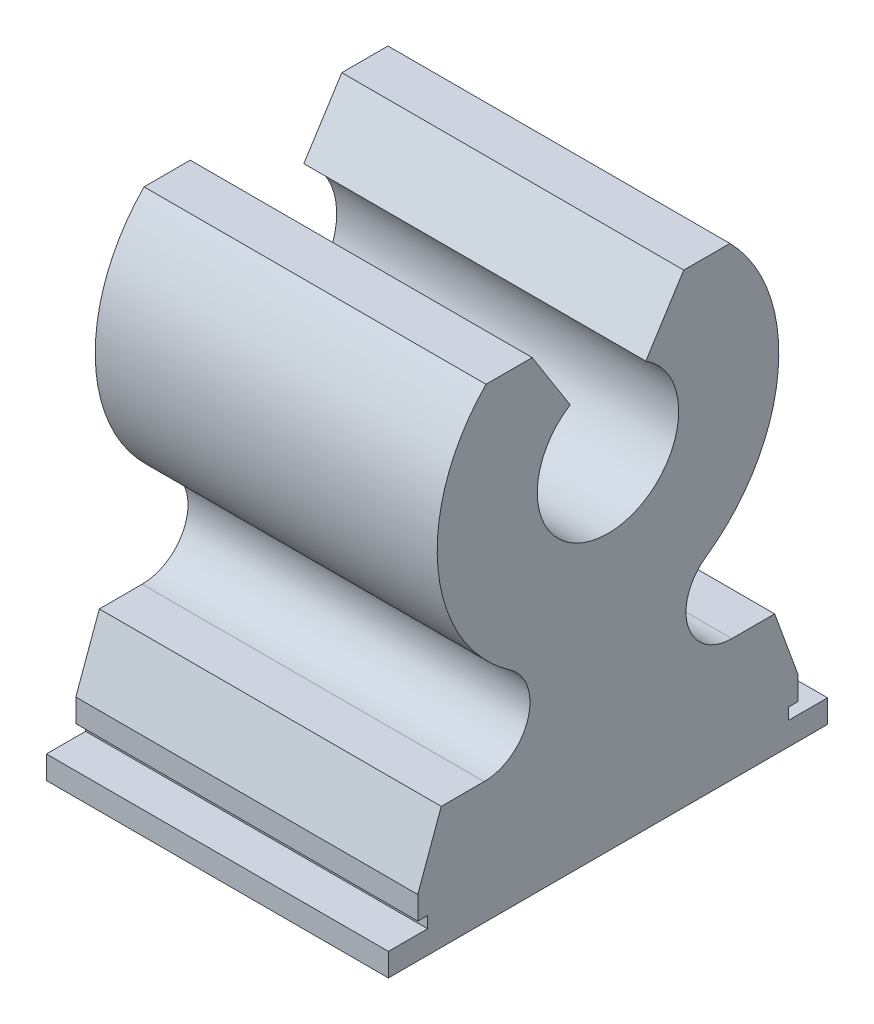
ISO-10303-21;
HEADER;
FILE_DESCRIPTION(('STEP AP214'),'2;1');
FILE_NAME('part.step','',(''),(''),'','','');
FILE_SCHEMA(('AUTOMOTIVE_DESIGN { 1 0 10303 214 1 1 1 1 }'));
ENDSEC;
DATA;
#1=APPLICATION_CONTEXT('core data for automotive mechanical design processes');
#2=APPLICATION_PROTOCOL_DEFINITION('international standard','automotive_design',2000,#1);
#3=PRODUCT_CONTEXT('',#1,'mechanical');
#4=PRODUCT('Part','Part','',(#3));
#5=PRODUCT_RELATED_PRODUCT_CATEGORY('part','',(#4));
#6=PRODUCT_DEFINITION_FORMATION('','',#4);
#7=PRODUCT_DEFINITION_CONTEXT('part definition',#1,'design');
#8=PRODUCT_DEFINITION('design','',#6,#7);
#9=PRODUCT_DEFINITION_SHAPE('','',#8);
#10=(LENGTH_UNIT() NAMED_UNIT(*) SI_UNIT(.MILLI.,.METRE.));
#11=(NAMED_UNIT(*) PLANE_ANGLE_UNIT() SI_UNIT($,.RADIAN.));
#12=(NAMED_UNIT(*) SI_UNIT($,.STERADIAN.) SOLID_ANGLE_UNIT());
#13=UNCERTAINTY_MEASURE_WITH_UNIT(LENGTH_MEASURE(1.E-05),#10,'distance_accuracy_value','');
#14=(GEOMETRIC_REPRESENTATION_CONTEXT(3) GLOBAL_UNCERTAINTY_ASSIGNED_CONTEXT((#13)) GLOBAL_UNIT_ASSIGNED_CONTEXT((#10,
#11,#12)) REPRESENTATION_CONTEXT('',''));
#15=CARTESIAN_POINT('',(0.,0.,0.));
#16=DIRECTION('',(0.,0.,1.));
#17=DIRECTION('',(1.,0.,0.));
#18=AXIS2_PLACEMENT_3D('',#15,#16,#17);
#19=CARTESIAN_POINT('',(8.9,-9.,5.715));
#20=DIRECTION('',(0.,0.,-1.));
#21=DIRECTION('',(-1.,0.,0.));
#22=AXIS2_PLACEMENT_3D('',#19,#20,#21);
#23=PLANE('',#22);
#24=DIRECTION('',(0.,-1.,0.));
#25=VECTOR('',#24,1.);
#26=CARTESIAN_POINT('',(0.,-9.,5.715));
#27=LINE('',#26,#25);
#28=CARTESIAN_POINT('',(0.,-8.4,5.715));
#29=VERTEX_POINT('',#28);
#30=CARTESIAN_POINT('',(0.,-9.,5.715));
#31=VERTEX_POINT('',#30);
#32=EDGE_CURVE('E336',#29,#31,#27,.T.);
#33=ORIENTED_EDGE('',*,*,#32,.T.);
#34=DIRECTION('',(-1.,0.,0.));
#35=VECTOR('',#34,1.);
#36=CARTESIAN_POINT('',(8.9,-9.,5.715));
#37=LINE('',#36,#35);
#38=CARTESIAN_POINT('',(8.9,-9.,5.715));
#39=VERTEX_POINT('',#38);
#40=EDGE_CURVE('E291',#39,#31,#37,.T.);
#41=ORIENTED_EDGE('',*,*,#40,.F.);
#42=DIRECTION('',(0.,-1.,0.));
#43=VECTOR('',#42,1.);
#44=CARTESIAN_POINT('',(8.9,-9.,5.715));
#45=LINE('',#44,#43);
#46=CARTESIAN_POINT('',(8.9,-8.4,5.715));
#47=VERTEX_POINT('',#46);
#48=EDGE_CURVE('E234',#47,#39,#45,.T.);
#49=ORIENTED_EDGE('',*,*,#48,.F.);
#50=DIRECTION('',(-1.,0.,0.));
#51=VECTOR('',#50,1.);
#52=CARTESIAN_POINT('',(8.9,-8.4,5.715));
#53=LINE('',#52,#51);
#54=EDGE_CURVE('E235',#47,#29,#53,.T.);
#55=ORIENTED_EDGE('',*,*,#54,.T.);
#56=EDGE_LOOP('',(#33,#41,#49,#55));
#57=FACE_BOUND('',#56,.T.);
#58=ADVANCED_FACE('F32',(#57),#23,.F.);
#59=CARTESIAN_POINT('',(8.9,-9.,5.715));
#60=DIRECTION('',(0.,1.,0.));
#61=DIRECTION('',(0.,0.,1.));
#62=AXIS2_PLACEMENT_3D('',#59,#60,#61);
#63=PLANE('',#62);
#64=DIRECTION('',(0.,0.,-1.));
#65=VECTOR('',#64,1.);
#66=CARTESIAN_POINT('',(0.,-9.,5.715));
#67=LINE('',#66,#65);
#68=CARTESIAN_POINT('',(0.,-9.,-5.715));
#69=VERTEX_POINT('',#68);
#70=EDGE_CURVE('E338',#31,#69,#67,.T.);
#71=ORIENTED_EDGE('',*,*,#70,.T.);
#72=DIRECTION('',(-1.,0.,0.));
#73=VECTOR('',#72,1.);
#74=CARTESIAN_POINT('',(8.9,-9.,-5.715));
#75=LINE('',#74,#73);
#76=CARTESIAN_POINT('',(8.9,-9.,-5.715));
#77=VERTEX_POINT('',#76);
#78=EDGE_CURVE('E289',#77,#69,#75,.T.);
#79=ORIENTED_EDGE('',*,*,#78,.F.);
#80=DIRECTION('',(0.,0.,-1.));
#81=VECTOR('',#80,1.);
#82=CARTESIAN_POINT('',(8.9,-9.,5.715));
#83=LINE('',#82,#81);
#84=EDGE_CURVE('E385',#39,#77,#83,.T.);
#85=ORIENTED_EDGE('',*,*,#84,.F.);
#86=ORIENTED_EDGE('',*,*,#40,.T.);
#87=EDGE_LOOP('',(#71,#79,#85,#86));
#88=FACE_BOUND('',#87,.T.);
#89=ADVANCED_FACE('F434',(#88),#63,.F.);
#90=CARTESIAN_POINT('',(8.9,-9.,-5.715));
#91=DIRECTION('',(0.,0.,1.));
#92=DIRECTION('',(1.,0.,0.));
#93=AXIS2_PLACEMENT_3D('',#90,#91,#92);
#94=PLANE('',#93);
#95=DIRECTION('',(0.,1.,0.));
#96=VECTOR('',#95,1.);
#97=CARTESIAN_POINT('',(0.,-9.,-5.715));
#98=LINE('',#97,#96);
#99=CARTESIAN_POINT('',(0.,-8.4,-5.715));
#100=VERTEX_POINT('',#99);
#101=EDGE_CURVE('E340',#69,#100,#98,.T.);
#102=ORIENTED_EDGE('',*,*,#101,.T.);
#103=DIRECTION('',(-1.,0.,0.));
#104=VECTOR('',#103,1.);
#105=CARTESIAN_POINT('',(8.9,-8.4,-5.715));
#106=LINE('',#105,#104);
#107=CARTESIAN_POINT('',(8.9,-8.4,-5.715));
#108=VERTEX_POINT('',#107);
#109=EDGE_CURVE('E286',#108,#100,#106,.T.);
#110=ORIENTED_EDGE('',*,*,#109,.F.);
#111=DIRECTION('',(0.,1.,0.));
#112=VECTOR('',#111,1.);
#113=CARTESIAN_POINT('',(8.9,-9.,-5.715));
#114=LINE('',#113,#112);
#115=EDGE_CURVE('E387',#77,#108,#114,.T.);
#116=ORIENTED_EDGE('',*,*,#115,.F.);
#117=ORIENTED_EDGE('',*,*,#78,.T.);
#118=EDGE_LOOP('',(#102,#110,#116,#117));
#119=FACE_BOUND('',#118,.T.);
#120=ADVANCED_FACE('F430',(#119),#94,.F.);
#121=CARTESIAN_POINT('',(8.9,-8.4,-5.715));
#122=DIRECTION('',(0.,-1.,0.));
#123=DIRECTION('',(0.,0.,-1.));
#124=AXIS2_PLACEMENT_3D('',#121,#122,#123);
#125=PLANE('',#124);
#126=DIRECTION('',(0.,0.,1.));
#127=VECTOR('',#126,1.);
#128=CARTESIAN_POINT('',(0.,-8.4,-5.715));
#129=LINE('',#128,#127);
#130=CARTESIAN_POINT('',(0.,-8.4,-4.695));
#131=VERTEX_POINT('',#130);
#132=EDGE_CURVE('E342',#100,#131,#129,.T.);
#133=ORIENTED_EDGE('',*,*,#132,.T.);
#134=DIRECTION('',(-1.,0.,0.));
#135=VECTOR('',#134,1.);
#136=CARTESIAN_POINT('',(8.9,-8.4,-4.695));
#137=LINE('',#136,#135);
#138=CARTESIAN_POINT('',(8.9,-8.4,-4.695));
#139=VERTEX_POINT('',#138);
#140=EDGE_CURVE('E283',#139,#131,#137,.T.);
#141=ORIENTED_EDGE('',*,*,#140,.F.);
#142=DIRECTION('',(0.,0.,1.));
#143=VECTOR('',#142,1.);
#144=CARTESIAN_POINT('',(8.9,-8.4,-5.715));
#145=LINE('',#144,#143);
#146=EDGE_CURVE('E389',#108,#139,#145,.T.);
#147=ORIENTED_EDGE('',*,*,#146,.F.);
#148=ORIENTED_EDGE('',*,*,#109,.T.);
#149=EDGE_LOOP('',(#133,#141,#147,#148));
#150=FACE_BOUND('',#149,.T.);
#151=ADVANCED_FACE('F426',(#150),#125,.F.);
#152=CARTESIAN_POINT('',(8.9,-8.4,-4.695));
#153=DIRECTION('',(0.,0.,1.));
#154=DIRECTION('',(0.,-1.,0.));
#155=AXIS2_PLACEMENT_3D('',#152,#153,#154);
#156=PLANE('',#155);
#157=DIRECTION('',(0.,1.,0.));
#158=VECTOR('',#157,1.);
#159=CARTESIAN_POINT('',(0.,-8.4,-4.695));
#160=LINE('',#159,#158);
#161=CARTESIAN_POINT('',(0.,-8.1,-4.695));
#162=VERTEX_POINT('',#161);
#163=EDGE_CURVE('E344',#131,#162,#160,.T.);
#164=ORIENTED_EDGE('',*,*,#163,.T.);
#165=DIRECTION('',(-1.,0.,0.));
#166=VECTOR('',#165,1.);
#167=CARTESIAN_POINT('',(8.9,-8.1,-4.695));
#168=LINE('',#167,#166);
#169=CARTESIAN_POINT('',(8.9,-8.1,-4.695));
#170=VERTEX_POINT('',#169);
#171=EDGE_CURVE('E280',#170,#162,#168,.T.);
#172=ORIENTED_EDGE('',*,*,#171,.F.);
#173=DIRECTION('',(0.,1.,0.));
#174=VECTOR('',#173,1.);
#175=CARTESIAN_POINT('',(8.9,-8.4,-4.695));
#176=LINE('',#175,#174);
#177=EDGE_CURVE('E391',#139,#170,#176,.T.);
#178=ORIENTED_EDGE('',*,*,#177,.F.);
#179=ORIENTED_EDGE('',*,*,#140,.T.);
#180=EDGE_LOOP('',(#164,#172,#178,#179));
#181=FACE_BOUND('',#180,.T.);
#182=ADVANCED_FACE('F421',(#181),#156,.F.);
#183=CARTESIAN_POINT('',(8.9,-8.1,-4.695));
#184=DIRECTION('',(0.,1.,0.));
#185=DIRECTION('',(0.,0.,1.));
#186=AXIS2_PLACEMENT_3D('',#183,#184,#185);
#187=PLANE('',#186);
#188=DIRECTION('',(0.,0.,-1.));
#189=VECTOR('',#188,1.);
#190=CARTESIAN_POINT('',(0.,-8.1,-4.695));
#191=LINE('',#190,#189);
#192=CARTESIAN_POINT('',(0.,-8.1,-4.95));
#193=VERTEX_POINT('',#192);
#194=EDGE_CURVE('E346',#162,#193,#191,.T.);
#195=ORIENTED_EDGE('',*,*,#194,.T.);
#196=DIRECTION('',(-1.,0.,0.));
#197=VECTOR('',#196,1.);
#198=CARTESIAN_POINT('',(8.9,-8.1,-4.95));
#199=LINE('',#198,#197);
#200=CARTESIAN_POINT('',(8.9,-8.1,-4.95));
#201=VERTEX_POINT('',#200);
#202=EDGE_CURVE('E277',#201,#193,#199,.T.);
#203=ORIENTED_EDGE('',*,*,#202,.F.);
#204=DIRECTION('',(0.,0.,-1.));
#205=VECTOR('',#204,1.);
#206=CARTESIAN_POINT('',(8.9,-8.1,-4.695));
#207=LINE('',#206,#205);
#208=EDGE_CURVE('E393',#170,#201,#207,.T.);
#209=ORIENTED_EDGE('',*,*,#208,.F.);
#210=ORIENTED_EDGE('',*,*,#171,.T.);
#211=EDGE_LOOP('',(#195,#203,#209,#210));
#212=FACE_BOUND('',#211,.T.);
#213=ADVANCED_FACE('F415',(#212),#187,.F.);
#214=CARTESIAN_POINT('',(8.9,-7.5,-4.95));
#215=DIRECTION('',(0.,0.,1.));
#216=DIRECTION('',(1.,0.,0.));
#217=AXIS2_PLACEMENT_3D('',#214,#215,#216);
#218=PLANE('',#217);
#219=DIRECTION('',(0.,1.,0.));
#220=VECTOR('',#219,1.);
#221=CARTESIAN_POINT('',(0.,-7.5,-4.95));
#222=LINE('',#221,#220);
#223=CARTESIAN_POINT('',(0.,-7.5,-4.95));
#224=VERTEX_POINT('',#223);
#225=EDGE_CURVE('E348',#193,#224,#222,.T.);
#226=ORIENTED_EDGE('',*,*,#225,.T.);
#227=DIRECTION('',(-1.,0.,0.));
#228=VECTOR('',#227,1.);
#229=CARTESIAN_POINT('',(8.9,-7.5,-4.95));
#230=LINE('',#229,#228);
#231=CARTESIAN_POINT('',(8.9,-7.5,-4.95));
#232=VERTEX_POINT('',#231);
#233=EDGE_CURVE('E274',#232,#224,#230,.T.);
#234=ORIENTED_EDGE('',*,*,#233,.F.);
#235=DIRECTION('',(0.,1.,0.));
#236=VECTOR('',#235,1.);
#237=CARTESIAN_POINT('',(8.9,-7.5,-4.95));
#238=LINE('',#237,#236);
#239=EDGE_CURVE('E395',#201,#232,#238,.T.);
#240=ORIENTED_EDGE('',*,*,#239,.F.);
#241=ORIENTED_EDGE('',*,*,#202,.T.);
#242=EDGE_LOOP('',(#226,#234,#240,#241));
#243=FACE_BOUND('',#242,.T.);
#244=ADVANCED_FACE('F411',(#243),#218,.F.);
#245=CARTESIAN_POINT('',(8.9,-5.82,-4.33853000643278));
#246=DIRECTION('',(0.,-0.342020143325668,0.939692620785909));
#247=DIRECTION('',(0.,-0.939692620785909,-0.342020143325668));
#248=AXIS2_PLACEMENT_3D('',#245,#246,#247);
#249=PLANE('',#248);
#250=DIRECTION('',(0.,0.939692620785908,0.342020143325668));
#251=VECTOR('',#250,1.);
#252=CARTESIAN_POINT('',(0.,-5.82,-4.33853000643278));
#253=LINE('',#252,#251);
#254=CARTESIAN_POINT('',(0.,-5.82,-4.33853000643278));
#255=VERTEX_POINT('',#254);
#256=EDGE_CURVE('E350',#224,#255,#253,.T.);
#257=ORIENTED_EDGE('',*,*,#256,.T.);
#258=DIRECTION('',(-1.,0.,0.));
#259=VECTOR('',#258,1.);
#260=CARTESIAN_POINT('',(8.9,-5.82,-4.33853000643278));
#261=LINE('',#260,#259);
#262=CARTESIAN_POINT('',(8.9,-5.82,-4.33853000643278));
#263=VERTEX_POINT('',#262);
#264=EDGE_CURVE('E271',#263,#255,#261,.T.);
#265=ORIENTED_EDGE('',*,*,#264,.F.);
#266=DIRECTION('',(0.,0.939692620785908,0.342020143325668));
#267=VECTOR('',#266,1.);
#268=CARTESIAN_POINT('',(8.9,-5.82,-4.33853000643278));
#269=LINE('',#268,#267);
#270=EDGE_CURVE('E397',#232,#263,#269,.T.);
#271=ORIENTED_EDGE('',*,*,#270,.F.);
#272=ORIENTED_EDGE('',*,*,#233,.T.);
#273=EDGE_LOOP('',(#257,#265,#271,#272));
#274=FACE_BOUND('',#273,.T.);
#275=ADVANCED_FACE('F407',(#274),#249,.F.);
#276=CARTESIAN_POINT('',(8.9,-5.82,-4.33853000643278));
#277=DIRECTION('',(0.,-1.,0.));
#278=DIRECTION('',(0.,0.,-1.));
#279=AXIS2_PLACEMENT_3D('',#276,#277,#278);
#280=PLANE('',#279);
#281=DIRECTION('',(0.,0.,1.));
#282=VECTOR('',#281,1.);
#283=CARTESIAN_POINT('',(0.,-5.82,-4.33853000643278));
#284=LINE('',#283,#282);
#285=CARTESIAN_POINT('',(0.,-5.82,-3.22369685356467));
#286=VERTEX_POINT('',#285);
#287=EDGE_CURVE('E352',#255,#286,#284,.T.);
#288=ORIENTED_EDGE('',*,*,#287,.T.);
#289=DIRECTION('',(-1.,0.,0.));
#290=VECTOR('',#289,1.);
#291=CARTESIAN_POINT('',(8.9,-5.82,-3.22369685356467));
#292=LINE('',#291,#290);
#293=CARTESIAN_POINT('',(8.9,-5.82,-3.22369685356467));
#294=VERTEX_POINT('',#293);
#295=EDGE_CURVE('E268',#294,#286,#292,.T.);
#296=ORIENTED_EDGE('',*,*,#295,.F.);
#297=DIRECTION('',(0.,0.,1.));
#298=VECTOR('',#297,1.);
#299=CARTESIAN_POINT('',(8.9,-5.82,-4.33853000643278));
#300=LINE('',#299,#298);
#301=EDGE_CURVE('E369',#263,#294,#300,.T.);
#302=ORIENTED_EDGE('',*,*,#301,.F.);
#303=ORIENTED_EDGE('',*,*,#264,.T.);
#304=EDGE_LOOP('',(#288,#296,#302,#303));
#305=FACE_BOUND('',#304,.T.);
#306=ADVANCED_FACE('F402',(#305),#280,.F.);
#307=CARTESIAN_POINT('',(8.9,-4.62630314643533,-3.22369685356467));
#308=DIRECTION('',(-1.,0.,0.));
#309=DIRECTION('',(0.,0.,1.));
#310=AXIS2_PLACEMENT_3D('',#307,#308,#309);
#311=CYLINDRICAL_SURFACE('',#310,1.19369685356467);
#312=CARTESIAN_POINT('',(0.,-4.62630314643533,-3.22369685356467));
#313=DIRECTION('',(-1.,0.,0.));
#314=DIRECTION('',(0.,0.,1.));
#315=AXIS2_PLACEMENT_3D('',#312,#313,#314);
#316=CIRCLE('',#315,1.19369685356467);
#317=CARTESIAN_POINT('',(0.,-3.64692729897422,-2.5412489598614));
#318=VERTEX_POINT('',#317);
#319=EDGE_CURVE('E212',#286,#318,#316,.T.);
#320=ORIENTED_EDGE('',*,*,#319,.T.);
#321=DIRECTION('',(-1.,0.,0.));
#322=VECTOR('',#321,1.);
#323=CARTESIAN_POINT('',(8.9,-3.64692729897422,-2.5412489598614));
#324=LINE('',#323,#322);
#325=CARTESIAN_POINT('',(8.9,-3.64692729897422,-2.5412489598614));
#326=VERTEX_POINT('',#325);
#327=EDGE_CURVE('E265',#326,#318,#324,.T.);
#328=ORIENTED_EDGE('',*,*,#327,.F.);
#329=CARTESIAN_POINT('',(8.9,-4.62630314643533,-3.22369685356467));
#330=DIRECTION('',(-1.,0.,0.));
#331=DIRECTION('',(0.,0.,1.));
#332=AXIS2_PLACEMENT_3D('',#329,#330,#331);
#333=CIRCLE('',#332,1.19369685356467);
#334=EDGE_CURVE('E365',#294,#326,#333,.T.);
#335=ORIENTED_EDGE('',*,*,#334,.F.);
#336=ORIENTED_EDGE('',*,*,#295,.T.);
#337=EDGE_LOOP('',(#320,#328,#335,#336));
#338=FACE_BOUND('',#337,.T.);
#339=ADVANCED_FACE('F356',(#338),#311,.F.);
#340=CARTESIAN_POINT('',(8.9,0.,0.));
#341=DIRECTION('',(-1.,0.,0.));
#342=DIRECTION('',(0.,0.,1.));
#343=AXIS2_PLACEMENT_3D('',#340,#341,#342);
#344=CYLINDRICAL_SURFACE('',#343,4.445);
#345=CARTESIAN_POINT('',(0.,0.,0.));
#346=DIRECTION('',(1.,0.,0.));
#347=DIRECTION('',(0.,0.,-1.));
#348=AXIS2_PLACEMENT_3D('',#345,#346,#347);
#349=CIRCLE('',#348,4.445);
#350=CARTESIAN_POINT('',(0.,3.1115,-3.1743649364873));
#351=VERTEX_POINT('',#350);
#352=EDGE_CURVE('E208',#318,#351,#349,.T.);
#353=ORIENTED_EDGE('',*,*,#352,.T.);
#354=DIRECTION('',(-1.,0.,0.));
#355=VECTOR('',#354,1.);
#356=CARTESIAN_POINT('',(8.9,3.1115,-3.1743649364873));
#357=LINE('',#356,#355);
#358=CARTESIAN_POINT('',(8.9,3.1115,-3.1743649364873));
#359=VERTEX_POINT('',#358);
#360=EDGE_CURVE('E45',#351,#359,#357,.F.);
#361=ORIENTED_EDGE('',*,*,#360,.T.);
#362=CARTESIAN_POINT('',(8.9,0.,0.));
#363=DIRECTION('',(1.,0.,0.));
#364=DIRECTION('',(0.,0.,-1.));
#365=AXIS2_PLACEMENT_3D('',#362,#363,#364);
#366=CIRCLE('',#365,4.445);
#367=EDGE_CURVE('E364',#326,#359,#366,.T.);
#368=ORIENTED_EDGE('',*,*,#367,.F.);
#369=ORIENTED_EDGE('',*,*,#327,.T.);
#370=EDGE_LOOP('',(#353,#361,#368,#369));
#371=FACE_BOUND('',#370,.T.);
#372=ADVANCED_FACE('F362',(#371),#344,.T.);
#373=CARTESIAN_POINT('',(8.9,1.55414767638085,-0.985));
#374=DIRECTION('',(0.,-0.535326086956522,-0.844645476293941));
#375=DIRECTION('',(0.,0.844645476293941,-0.535326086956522));
#376=AXIS2_PLACEMENT_3D('',#373,#374,#375);
#377=PLANE('',#376);
#378=DIRECTION('',(0.,-0.844645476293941,0.535326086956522));
#379=VECTOR('',#378,1.);
#380=CARTESIAN_POINT('',(8.9,1.55414767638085,-0.985));
#381=LINE('',#380,#379);
#382=CARTESIAN_POINT('',(8.9,3.1115,-1.97203106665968));
#383=VERTEX_POINT('',#382);
#384=CARTESIAN_POINT('',(8.9,1.55414767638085,-0.985));
#385=VERTEX_POINT('',#384);
#386=EDGE_CURVE('E202',#383,#385,#381,.T.);
#387=ORIENTED_EDGE('',*,*,#386,.F.);
#388=DIRECTION('',(-1.,0.,0.));
#389=VECTOR('',#388,1.);
#390=CARTESIAN_POINT('',(8.9,3.1115,-1.97203106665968));
#391=LINE('',#390,#389);
#392=CARTESIAN_POINT('',(0.,3.1115,-1.97203106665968));
#393=VERTEX_POINT('',#392);
#394=EDGE_CURVE('E190',#383,#393,#391,.T.);
#395=ORIENTED_EDGE('',*,*,#394,.T.);
#396=DIRECTION('',(0.,-0.844645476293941,0.535326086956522));
#397=VECTOR('',#396,1.);
#398=CARTESIAN_POINT('',(0.,1.55414767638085,-0.985));
#399=LINE('',#398,#397);
#400=CARTESIAN_POINT('',(0.,1.55414767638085,-0.985));
#401=VERTEX_POINT('',#400);
#402=EDGE_CURVE('E200',#393,#401,#399,.T.);
#403=ORIENTED_EDGE('',*,*,#402,.T.);
#404=DIRECTION('',(-1.,0.,0.));
#405=VECTOR('',#404,1.);
#406=CARTESIAN_POINT('',(8.9,1.55414767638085,-0.985));
#407=LINE('',#406,#405);
#408=EDGE_CURVE('E263',#385,#401,#407,.T.);
#409=ORIENTED_EDGE('',*,*,#408,.F.);
#410=EDGE_LOOP('',(#387,#395,#403,#409));
#411=FACE_BOUND('',#410,.T.);
#412=ADVANCED_FACE('F198',(#411),#377,.F.);
#413=CARTESIAN_POINT('',(8.9,0.,0.));
#414=DIRECTION('',(-1.,0.,0.));
#415=DIRECTION('',(0.,0.,1.));
#416=AXIS2_PLACEMENT_3D('',#413,#414,#415);
#417=CYLINDRICAL_SURFACE('',#416,1.84);
#418=CARTESIAN_POINT('',(0.,0.,0.));
#419=DIRECTION('',(-1.,0.,0.));
#420=DIRECTION('',(0.,0.,-1.));
#421=AXIS2_PLACEMENT_3D('',#418,#419,#420);
#422=CIRCLE('',#421,1.84);
#423=CARTESIAN_POINT('',(0.,1.55414767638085,0.985));
#424=VERTEX_POINT('',#423);
#425=EDGE_CURVE('E207',#401,#424,#422,.T.);
#426=ORIENTED_EDGE('',*,*,#425,.T.);
#427=DIRECTION('',(-1.,0.,0.));
#428=VECTOR('',#427,1.);
#429=CARTESIAN_POINT('',(8.9,1.55414767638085,0.985));
#430=LINE('',#429,#428);
#431=CARTESIAN_POINT('',(8.9,1.55414767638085,0.985));
#432=VERTEX_POINT('',#431);
#433=EDGE_CURVE('E260',#432,#424,#430,.T.);
#434=ORIENTED_EDGE('',*,*,#433,.F.);
#435=CARTESIAN_POINT('',(8.9,0.,0.));
#436=DIRECTION('',(-1.,0.,0.));
#437=DIRECTION('',(0.,0.,-1.));
#438=AXIS2_PLACEMENT_3D('',#435,#436,#437);
#439=CIRCLE('',#438,1.84);
#440=EDGE_CURVE('E367',#385,#432,#439,.T.);
#441=ORIENTED_EDGE('',*,*,#440,.F.);
#442=ORIENTED_EDGE('',*,*,#408,.T.);
#443=EDGE_LOOP('',(#426,#434,#441,#442));
#444=FACE_BOUND('',#443,.T.);
#445=ADVANCED_FACE('F494',(#444),#417,.F.);
#446=CARTESIAN_POINT('',(8.9,1.55414767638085,0.985));
#447=DIRECTION('',(0.,-0.535326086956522,0.844645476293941));
#448=DIRECTION('',(0.,-0.844645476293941,-0.535326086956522));
#449=AXIS2_PLACEMENT_3D('',#446,#447,#448);
#450=PLANE('',#449);
#451=DIRECTION('',(0.,0.844645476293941,0.535326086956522));
#452=VECTOR('',#451,1.);
#453=CARTESIAN_POINT('',(0.,1.55414767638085,0.985));
#454=LINE('',#453,#452);
#455=CARTESIAN_POINT('',(0.,3.1115,1.97203106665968));
#456=VERTEX_POINT('',#455);
#457=EDGE_CURVE('E210',#424,#456,#454,.T.);
#458=ORIENTED_EDGE('',*,*,#457,.T.);
#459=DIRECTION('',(1.,0.,0.));
#460=VECTOR('',#459,1.);
#461=CARTESIAN_POINT('',(8.9,3.1115,1.97203106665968));
#462=LINE('',#461,#460);
#463=CARTESIAN_POINT('',(8.9,3.1115,1.97203106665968));
#464=VERTEX_POINT('',#463);
#465=EDGE_CURVE('E53',#456,#464,#462,.T.);
#466=ORIENTED_EDGE('',*,*,#465,.T.);
#467=DIRECTION('',(0.,0.844645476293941,0.535326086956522));
#468=VECTOR('',#467,1.);
#469=CARTESIAN_POINT('',(8.9,1.55414767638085,0.985));
#470=LINE('',#469,#468);
#471=EDGE_CURVE('E374',#432,#464,#470,.T.);
#472=ORIENTED_EDGE('',*,*,#471,.F.);
#473=ORIENTED_EDGE('',*,*,#433,.T.);
#474=EDGE_LOOP('',(#458,#466,#472,#473));
#475=FACE_BOUND('',#474,.T.);
#476=ADVANCED_FACE('F497',(#475),#450,.F.);
#477=CARTESIAN_POINT('',(8.9,0.,0.));
#478=DIRECTION('',(-1.,0.,0.));
#479=DIRECTION('',(0.,0.,1.));
#480=AXIS2_PLACEMENT_3D('',#477,#478,#479);
#481=CYLINDRICAL_SURFACE('',#480,4.445);
#482=CARTESIAN_POINT('',(8.9,0.,0.));
#483=DIRECTION('',(1.,0.,0.));
#484=DIRECTION('',(0.,0.,-1.));
#485=AXIS2_PLACEMENT_3D('',#482,#483,#484);
#486=CIRCLE('',#485,4.445);
#487=CARTESIAN_POINT('',(8.9,3.1115,3.17436493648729));
#488=VERTEX_POINT('',#487);
#489=CARTESIAN_POINT('',(8.9,-3.64692729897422,2.5412489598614));
#490=VERTEX_POINT('',#489);
#491=EDGE_CURVE('E305',#488,#490,#486,.T.);
#492=ORIENTED_EDGE('',*,*,#491,.F.);
#493=DIRECTION('',(-1.,0.,0.));
#494=VECTOR('',#493,1.);
#495=CARTESIAN_POINT('',(8.9,3.1115,3.1743649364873));
#496=LINE('',#495,#494);
#497=CARTESIAN_POINT('',(0.,3.1115,3.17436493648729));
#498=VERTEX_POINT('',#497);
#499=EDGE_CURVE('E298',#488,#498,#496,.T.);
#500=ORIENTED_EDGE('',*,*,#499,.T.);
#501=CARTESIAN_POINT('',(0.,0.,0.));
#502=DIRECTION('',(1.,0.,0.));
#503=DIRECTION('',(0.,0.,-1.));
#504=AXIS2_PLACEMENT_3D('',#501,#502,#503);
#505=CIRCLE('',#504,4.445);
#506=CARTESIAN_POINT('',(0.,-3.64692729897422,2.5412489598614));
#507=VERTEX_POINT('',#506);
#508=EDGE_CURVE('E218',#498,#507,#505,.T.);
#509=ORIENTED_EDGE('',*,*,#508,.T.);
#510=DIRECTION('',(-1.,0.,0.));
#511=VECTOR('',#510,1.);
#512=CARTESIAN_POINT('',(8.9,-3.64692729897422,2.5412489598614));
#513=LINE('',#512,#511);
#514=EDGE_CURVE('E257',#490,#507,#513,.T.);
#515=ORIENTED_EDGE('',*,*,#514,.F.);
#516=EDGE_LOOP('',(#492,#500,#509,#515));
#517=FACE_BOUND('',#516,.T.);
#518=ADVANCED_FACE('F303',(#517),#481,.T.);
#519=CARTESIAN_POINT('',(8.9,-4.62630314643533,3.22369685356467));
#520=DIRECTION('',(-1.,0.,0.));
#521=DIRECTION('',(0.,0.,1.));
#522=AXIS2_PLACEMENT_3D('',#519,#520,#521);
#523=CYLINDRICAL_SURFACE('',#522,1.19369685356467);
#524=CARTESIAN_POINT('',(0.,-4.62630314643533,3.22369685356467));
#525=DIRECTION('',(-1.,0.,0.));
#526=DIRECTION('',(0.,0.,1.));
#527=AXIS2_PLACEMENT_3D('',#524,#525,#526);
#528=CIRCLE('',#527,1.19369685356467);
#529=CARTESIAN_POINT('',(0.,-5.82,3.22369685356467));
#530=VERTEX_POINT('',#529);
#531=EDGE_CURVE('E220',#507,#530,#528,.T.);
#532=ORIENTED_EDGE('',*,*,#531,.T.);
#533=DIRECTION('',(-1.,0.,0.));
#534=VECTOR('',#533,1.);
#535=CARTESIAN_POINT('',(8.9,-5.82,3.22369685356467));
#536=LINE('',#535,#534);
#537=CARTESIAN_POINT('',(8.9,-5.82,3.22369685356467));
#538=VERTEX_POINT('',#537);
#539=EDGE_CURVE('E254',#538,#530,#536,.T.);
#540=ORIENTED_EDGE('',*,*,#539,.F.);
#541=CARTESIAN_POINT('',(8.9,-4.62630314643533,3.22369685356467));
#542=DIRECTION('',(-1.,0.,0.));
#543=DIRECTION('',(0.,0.,1.));
#544=AXIS2_PLACEMENT_3D('',#541,#542,#543);
#545=CIRCLE('',#544,1.19369685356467);
#546=EDGE_CURVE('E323',#490,#538,#545,.T.);
#547=ORIENTED_EDGE('',*,*,#546,.F.);
#548=ORIENTED_EDGE('',*,*,#514,.T.);
#549=EDGE_LOOP('',(#532,#540,#547,#548));
#550=FACE_BOUND('',#549,.T.);
#551=ADVANCED_FACE('F313',(#550),#523,.F.);
#552=CARTESIAN_POINT('',(8.9,-5.82,3.22369685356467));
#553=DIRECTION('',(0.,-1.,0.));
#554=DIRECTION('',(0.,0.,-1.));
#555=AXIS2_PLACEMENT_3D('',#552,#553,#554);
#556=PLANE('',#555);
#557=DIRECTION('',(0.,0.,1.));
#558=VECTOR('',#557,1.);
#559=CARTESIAN_POINT('',(0.,-5.82,3.22369685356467));
#560=LINE('',#559,#558);
#561=CARTESIAN_POINT('',(0.,-5.82,4.33853000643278));
#562=VERTEX_POINT('',#561);
#563=EDGE_CURVE('E222',#530,#562,#560,.T.);
#564=ORIENTED_EDGE('',*,*,#563,.T.);
#565=DIRECTION('',(-1.,0.,0.));
#566=VECTOR('',#565,1.);
#567=CARTESIAN_POINT('',(8.9,-5.82,4.33853000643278));
#568=LINE('',#567,#566);
#569=CARTESIAN_POINT('',(8.9,-5.82,4.33853000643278));
#570=VERTEX_POINT('',#569);
#571=EDGE_CURVE('E251',#570,#562,#568,.T.);
#572=ORIENTED_EDGE('',*,*,#571,.F.);
#573=DIRECTION('',(0.,0.,1.));
#574=VECTOR('',#573,1.);
#575=CARTESIAN_POINT('',(8.9,-5.82,3.22369685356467));
#576=LINE('',#575,#574);
#577=EDGE_CURVE('E319',#538,#570,#576,.T.);
#578=ORIENTED_EDGE('',*,*,#577,.F.);
#579=ORIENTED_EDGE('',*,*,#539,.T.);
#580=EDGE_LOOP('',(#564,#572,#578,#579));
#581=FACE_BOUND('',#580,.T.);
#582=ADVANCED_FACE('F317',(#581),#556,.F.);
#583=CARTESIAN_POINT('',(8.9,-5.82,4.33853000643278));
#584=DIRECTION('',(0.,-0.342020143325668,-0.939692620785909));
#585=DIRECTION('',(0.,0.939692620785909,-0.342020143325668));
#586=AXIS2_PLACEMENT_3D('',#583,#584,#585);
#587=PLANE('',#586);
#588=DIRECTION('',(0.,-0.939692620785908,0.342020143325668));
#589=VECTOR('',#588,1.);
#590=CARTESIAN_POINT('',(0.,-5.82,4.33853000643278));
#591=LINE('',#590,#589);
#592=CARTESIAN_POINT('',(0.,-7.5,4.95));
#593=VERTEX_POINT('',#592);
#594=EDGE_CURVE('E224',#562,#593,#591,.T.);
#595=ORIENTED_EDGE('',*,*,#594,.T.);
#596=DIRECTION('',(-1.,0.,0.));
#597=VECTOR('',#596,1.);
#598=CARTESIAN_POINT('',(8.9,-7.5,4.95));
#599=LINE('',#598,#597);
#600=CARTESIAN_POINT('',(8.9,-7.5,4.95));
#601=VERTEX_POINT('',#600);
#602=EDGE_CURVE('E248',#601,#593,#599,.T.);
#603=ORIENTED_EDGE('',*,*,#602,.F.);
#604=DIRECTION('',(0.,-0.939692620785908,0.342020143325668));
#605=VECTOR('',#604,1.);
#606=CARTESIAN_POINT('',(8.9,-5.82,4.33853000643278));
#607=LINE('',#606,#605);
#608=EDGE_CURVE('E322',#570,#601,#607,.T.);
#609=ORIENTED_EDGE('',*,*,#608,.F.);
#610=ORIENTED_EDGE('',*,*,#571,.T.);
#611=EDGE_LOOP('',(#595,#603,#609,#610));
#612=FACE_BOUND('',#611,.T.);
#613=ADVANCED_FACE('F458',(#612),#587,.F.);
#614=CARTESIAN_POINT('',(8.9,-7.5,4.95));
#615=DIRECTION('',(0.,0.,-1.));
#616=DIRECTION('',(-1.,0.,0.));
#617=AXIS2_PLACEMENT_3D('',#614,#615,#616);
#618=PLANE('',#617);
#619=DIRECTION('',(0.,-1.,0.));
#620=VECTOR('',#619,1.);
#621=CARTESIAN_POINT('',(0.,-7.5,4.95));
#622=LINE('',#621,#620);
#623=CARTESIAN_POINT('',(0.,-8.1,4.95));
#624=VERTEX_POINT('',#623);
#625=EDGE_CURVE('E226',#593,#624,#622,.T.);
#626=ORIENTED_EDGE('',*,*,#625,.T.);
#627=DIRECTION('',(-1.,0.,0.));
#628=VECTOR('',#627,1.);
#629=CARTESIAN_POINT('',(8.9,-8.1,4.95));
#630=LINE('',#629,#628);
#631=CARTESIAN_POINT('',(8.9,-8.1,4.95));
#632=VERTEX_POINT('',#631);
#633=EDGE_CURVE('E245',#632,#624,#630,.T.);
#634=ORIENTED_EDGE('',*,*,#633,.F.);
#635=DIRECTION('',(0.,-1.,0.));
#636=VECTOR('',#635,1.);
#637=CARTESIAN_POINT('',(8.9,-7.5,4.95));
#638=LINE('',#637,#636);
#639=EDGE_CURVE('E325',#601,#632,#638,.T.);
#640=ORIENTED_EDGE('',*,*,#639,.F.);
#641=ORIENTED_EDGE('',*,*,#602,.T.);
#642=EDGE_LOOP('',(#626,#634,#640,#641));
#643=FACE_BOUND('',#642,.T.);
#644=ADVANCED_FACE('F455',(#643),#618,.F.);
#645=CARTESIAN_POINT('',(8.9,-8.1,4.695));
#646=DIRECTION('',(0.,1.,0.));
#647=DIRECTION('',(0.,0.,1.));
#648=AXIS2_PLACEMENT_3D('',#645,#646,#647);
#649=PLANE('',#648);
#650=DIRECTION('',(0.,0.,-1.));
#651=VECTOR('',#650,1.);
#652=CARTESIAN_POINT('',(0.,-8.1,4.695));
#653=LINE('',#652,#651);
#654=CARTESIAN_POINT('',(0.,-8.1,4.695));
#655=VERTEX_POINT('',#654);
#656=EDGE_CURVE('E228',#624,#655,#653,.T.);
#657=ORIENTED_EDGE('',*,*,#656,.T.);
#658=DIRECTION('',(-1.,0.,0.));
#659=VECTOR('',#658,1.);
#660=CARTESIAN_POINT('',(8.9,-8.1,4.695));
#661=LINE('',#660,#659);
#662=CARTESIAN_POINT('',(8.9,-8.1,4.695));
#663=VERTEX_POINT('',#662);
#664=EDGE_CURVE('E242',#663,#655,#661,.T.);
#665=ORIENTED_EDGE('',*,*,#664,.F.);
#666=DIRECTION('',(0.,0.,-1.));
#667=VECTOR('',#666,1.);
#668=CARTESIAN_POINT('',(8.9,-8.1,4.695));
#669=LINE('',#668,#667);
#670=EDGE_CURVE('E331',#632,#663,#669,.T.);
#671=ORIENTED_EDGE('',*,*,#670,.F.);
#672=ORIENTED_EDGE('',*,*,#633,.T.);
#673=EDGE_LOOP('',(#657,#665,#671,#672));
#674=FACE_BOUND('',#673,.T.);
#675=ADVANCED_FACE('F451',(#674),#649,.F.);
#676=CARTESIAN_POINT('',(8.9,-8.4,4.695));
#677=DIRECTION('',(0.,0.,-1.));
#678=DIRECTION('',(0.,1.,0.));
#679=AXIS2_PLACEMENT_3D('',#676,#677,#678);
#680=PLANE('',#679);
#681=DIRECTION('',(0.,-1.,0.));
#682=VECTOR('',#681,1.);
#683=CARTESIAN_POINT('',(0.,-8.4,4.695));
#684=LINE('',#683,#682);
#685=CARTESIAN_POINT('',(0.,-8.4,4.695));
#686=VERTEX_POINT('',#685);
#687=EDGE_CURVE('E230',#655,#686,#684,.T.);
#688=ORIENTED_EDGE('',*,*,#687,.T.);
#689=DIRECTION('',(-1.,0.,0.));
#690=VECTOR('',#689,1.);
#691=CARTESIAN_POINT('',(8.9,-8.4,4.695));
#692=LINE('',#691,#690);
#693=CARTESIAN_POINT('',(8.9,-8.4,4.695));
#694=VERTEX_POINT('',#693);
#695=EDGE_CURVE('E238',#694,#686,#692,.T.);
#696=ORIENTED_EDGE('',*,*,#695,.F.);
#697=DIRECTION('',(0.,-1.,0.));
#698=VECTOR('',#697,1.);
#699=CARTESIAN_POINT('',(8.9,-8.4,4.695));
#700=LINE('',#699,#698);
#701=EDGE_CURVE('E333',#663,#694,#700,.T.);
#702=ORIENTED_EDGE('',*,*,#701,.F.);
#703=ORIENTED_EDGE('',*,*,#664,.T.);
#704=EDGE_LOOP('',(#688,#696,#702,#703));
#705=FACE_BOUND('',#704,.T.);
#706=ADVANCED_FACE('F446',(#705),#680,.F.);
#707=CARTESIAN_POINT('',(8.9,-8.4,5.715));
#708=DIRECTION('',(0.,-1.,0.));
#709=DIRECTION('',(0.,0.,-1.));
#710=AXIS2_PLACEMENT_3D('',#707,#708,#709);
#711=PLANE('',#710);
#712=DIRECTION('',(0.,0.,1.));
#713=VECTOR('',#712,1.);
#714=CARTESIAN_POINT('',(0.,-8.4,5.715));
#715=LINE('',#714,#713);
#716=EDGE_CURVE('E232',#686,#29,#715,.T.);
#717=ORIENTED_EDGE('',*,*,#716,.T.);
#718=ORIENTED_EDGE('',*,*,#54,.F.);
#719=DIRECTION('',(0.,0.,1.));
#720=VECTOR('',#719,1.);
#721=CARTESIAN_POINT('',(8.9,-8.4,5.715));
#722=LINE('',#721,#720);
#723=EDGE_CURVE('E239',#694,#47,#722,.T.);
#724=ORIENTED_EDGE('',*,*,#723,.F.);
#725=ORIENTED_EDGE('',*,*,#695,.T.);
#726=EDGE_LOOP('',(#717,#718,#724,#725));
#727=FACE_BOUND('',#726,.T.);
#728=ADVANCED_FACE('F440',(#727),#711,.F.);
#729=CARTESIAN_POINT('',(8.9,-4.62630314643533,3.22369685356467));
#730=DIRECTION('',(-1.,0.,0.));
#731=DIRECTION('',(0.,0.,1.));
#732=AXIS2_PLACEMENT_3D('',#729,#730,#731);
#733=PLANE('',#732);
#734=ORIENTED_EDGE('',*,*,#367,.T.);
#735=DIRECTION('',(0.,0.,1.));
#736=VECTOR('',#735,1.);
#737=CARTESIAN_POINT('',(8.9,3.1115,-4.445));
#738=LINE('',#737,#736);
#739=EDGE_CURVE('E306',#359,#383,#738,.T.);
#740=ORIENTED_EDGE('',*,*,#739,.T.);
#741=ORIENTED_EDGE('',*,*,#386,.T.);
#742=ORIENTED_EDGE('',*,*,#440,.T.);
#743=ORIENTED_EDGE('',*,*,#471,.T.);
#744=EDGE_CURVE('E377',#464,#488,#738,.T.);
#745=ORIENTED_EDGE('',*,*,#744,.T.);
#746=ORIENTED_EDGE('',*,*,#491,.T.);
#747=ORIENTED_EDGE('',*,*,#546,.T.);
#748=ORIENTED_EDGE('',*,*,#577,.T.);
#749=ORIENTED_EDGE('',*,*,#608,.T.);
#750=ORIENTED_EDGE('',*,*,#639,.T.);
#751=ORIENTED_EDGE('',*,*,#670,.T.);
#752=ORIENTED_EDGE('',*,*,#701,.T.);
#753=ORIENTED_EDGE('',*,*,#723,.T.);
#754=ORIENTED_EDGE('',*,*,#48,.T.);
#755=ORIENTED_EDGE('',*,*,#84,.T.);
#756=ORIENTED_EDGE('',*,*,#115,.T.);
#757=ORIENTED_EDGE('',*,*,#146,.T.);
#758=ORIENTED_EDGE('',*,*,#177,.T.);
#759=ORIENTED_EDGE('',*,*,#208,.T.);
#760=ORIENTED_EDGE('',*,*,#239,.T.);
#761=ORIENTED_EDGE('',*,*,#270,.T.);
#762=ORIENTED_EDGE('',*,*,#301,.T.);
#763=ORIENTED_EDGE('',*,*,#334,.T.);
#764=EDGE_LOOP('',(#734,#740,#741,#742,#743,#745,#746,#747,#748,#749,#750,#751,#752,#753,#754,
#755,#756,#757,#758,#759,#760,#761,#762,#763));
#765=FACE_BOUND('',#764,.T.);
#766=ADVANCED_FACE('F376',(#765),#733,.F.);
#767=CARTESIAN_POINT('',(0.,-4.62630314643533,3.22369685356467));
#768=DIRECTION('',(-1.,0.,0.));
#769=DIRECTION('',(0.,0.,1.));
#770=AXIS2_PLACEMENT_3D('',#767,#768,#769);
#771=PLANE('',#770);
#772=DIRECTION('',(0.,0.,1.));
#773=VECTOR('',#772,1.);
#774=CARTESIAN_POINT('',(0.,3.1115,3.22369685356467));
#775=LINE('',#774,#773);
#776=EDGE_CURVE('E11',#351,#393,#775,.T.);
#777=ORIENTED_EDGE('',*,*,#776,.F.);
#778=ORIENTED_EDGE('',*,*,#352,.F.);
#779=ORIENTED_EDGE('',*,*,#319,.F.);
#780=ORIENTED_EDGE('',*,*,#287,.F.);
#781=ORIENTED_EDGE('',*,*,#256,.F.);
#782=ORIENTED_EDGE('',*,*,#225,.F.);
#783=ORIENTED_EDGE('',*,*,#194,.F.);
#784=ORIENTED_EDGE('',*,*,#163,.F.);
#785=ORIENTED_EDGE('',*,*,#132,.F.);
#786=ORIENTED_EDGE('',*,*,#101,.F.);
#787=ORIENTED_EDGE('',*,*,#70,.F.);
#788=ORIENTED_EDGE('',*,*,#32,.F.);
#789=ORIENTED_EDGE('',*,*,#716,.F.);
#790=ORIENTED_EDGE('',*,*,#687,.F.);
#791=ORIENTED_EDGE('',*,*,#656,.F.);
#792=ORIENTED_EDGE('',*,*,#625,.F.);
#793=ORIENTED_EDGE('',*,*,#594,.F.);
#794=ORIENTED_EDGE('',*,*,#563,.F.);
#795=ORIENTED_EDGE('',*,*,#531,.F.);
#796=ORIENTED_EDGE('',*,*,#508,.F.);
#797=EDGE_CURVE('E35',#456,#498,#775,.T.);
#798=ORIENTED_EDGE('',*,*,#797,.F.);
#799=ORIENTED_EDGE('',*,*,#457,.F.);
#800=ORIENTED_EDGE('',*,*,#425,.F.);
#801=ORIENTED_EDGE('',*,*,#402,.F.);
#802=EDGE_LOOP('',(#777,#778,#779,#780,#781,#782,#783,#784,#785,#786,#787,#788,#789,#790,#791,
#792,#793,#794,#795,#796,#798,#799,#800,#801));
#803=FACE_BOUND('',#802,.T.);
#804=ADVANCED_FACE('F205',(#803),#771,.T.);
#805=CARTESIAN_POINT('',(8.9,3.1115,-4.445));
#806=DIRECTION('',(0.,-1.,0.));
#807=DIRECTION('',(0.,0.,-1.));
#808=AXIS2_PLACEMENT_3D('',#805,#806,#807);
#809=PLANE('',#808);
#810=ORIENTED_EDGE('',*,*,#797,.T.);
#811=ORIENTED_EDGE('',*,*,#499,.F.);
#812=ORIENTED_EDGE('',*,*,#744,.F.);
#813=ORIENTED_EDGE('',*,*,#465,.F.);
#814=EDGE_LOOP('',(#810,#811,#812,#813));
#815=FACE_BOUND('',#814,.T.);
#816=ADVANCED_FACE('F297',(#815),#809,.F.);
#817=ORIENTED_EDGE('',*,*,#776,.T.);
#818=ORIENTED_EDGE('',*,*,#394,.F.);
#819=ORIENTED_EDGE('',*,*,#739,.F.);
#820=ORIENTED_EDGE('',*,*,#360,.F.);
#821=EDGE_LOOP('',(#817,#818,#819,#820));
#822=FACE_BOUND('',#821,.T.);
#823=ADVANCED_FACE('F189',(#822),#809,.F.);
#824=CLOSED_SHELL('',(#58,#89,#120,#151,#182,#213,#244,#275,#306,#339,#372,#412,#445,#476,#518,
#551,#582,#613,#644,#675,#706,#728,#766,#804,#816,#823));
#825=MANIFOLD_SOLID_BREP('B2',#824);
#826=ADVANCED_BREP_SHAPE_REPRESENTATION('',(#18,#825),#14);
#827=SHAPE_DEFINITION_REPRESENTATION(#9,#826);
ENDSEC;
END-ISO-10303-21;
